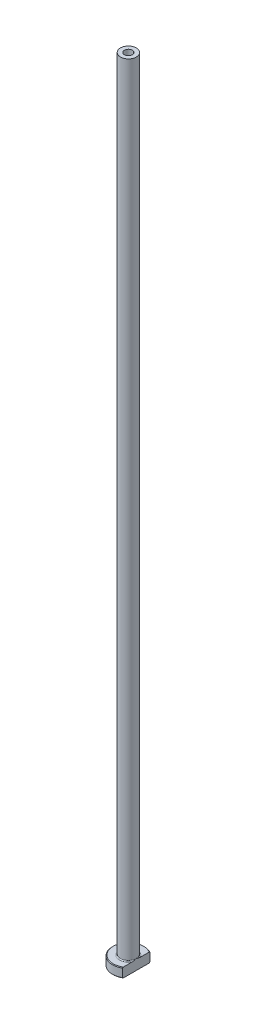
ISO-10303-21;
HEADER;
FILE_DESCRIPTION(('STEP AP214'),'2;1');
FILE_NAME('part.step','',(''),(''),'','','');
FILE_SCHEMA(('AUTOMOTIVE_DESIGN { 1 0 10303 214 1 1 1 1 }'));
ENDSEC;
DATA;
#1=APPLICATION_CONTEXT('core data for automotive mechanical design processes');
#2=APPLICATION_PROTOCOL_DEFINITION('international standard','automotive_design',2000,#1);
#3=PRODUCT_CONTEXT('',#1,'mechanical');
#4=PRODUCT('Part','Part','',(#3));
#5=PRODUCT_RELATED_PRODUCT_CATEGORY('part','',(#4));
#6=PRODUCT_DEFINITION_FORMATION('','',#4);
#7=PRODUCT_DEFINITION_CONTEXT('part definition',#1,'design');
#8=PRODUCT_DEFINITION('design','',#6,#7);
#9=PRODUCT_DEFINITION_SHAPE('','',#8);
#10=(LENGTH_UNIT() NAMED_UNIT(*) SI_UNIT(.MILLI.,.METRE.));
#11=(NAMED_UNIT(*) PLANE_ANGLE_UNIT() SI_UNIT($,.RADIAN.));
#12=(NAMED_UNIT(*) SI_UNIT($,.STERADIAN.) SOLID_ANGLE_UNIT());
#13=UNCERTAINTY_MEASURE_WITH_UNIT(LENGTH_MEASURE(1.E-05),#10,'distance_accuracy_value','');
#14=(GEOMETRIC_REPRESENTATION_CONTEXT(3) GLOBAL_UNCERTAINTY_ASSIGNED_CONTEXT((#13)) GLOBAL_UNIT_ASSIGNED_CONTEXT((#10,
#11,#12)) REPRESENTATION_CONTEXT('',''));
#15=CARTESIAN_POINT('',(0.,0.,0.));
#16=DIRECTION('',(0.,0.,1.));
#17=DIRECTION('',(1.,0.,0.));
#18=AXIS2_PLACEMENT_3D('',#15,#16,#17);
#19=CARTESIAN_POINT('',(0.,92.1876809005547,0.));
#20=DIRECTION('',(0.,1.,0.));
#21=DIRECTION('',(0.,0.,1.));
#22=AXIS2_PLACEMENT_3D('',#19,#20,#21);
#23=CYLINDRICAL_SURFACE('',#22,1.25000000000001);
#24=CARTESIAN_POINT('',(0.,250.,0.));
#25=DIRECTION('',(0.,1.,0.));
#26=DIRECTION('',(0.,0.,1.));
#27=AXIS2_PLACEMENT_3D('',#24,#25,#26);
#28=CIRCLE('',#27,1.25000000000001);
#29=CARTESIAN_POINT('',(0.,250.,1.25000000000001));
#30=VERTEX_POINT('',#29);
#31=EDGE_CURVE('E167',#30,#30,#28,.T.);
#32=ORIENTED_EDGE('',*,*,#31,.T.);
#33=EDGE_LOOP('',(#32));
#34=FACE_BOUND('',#33,.T.);
#35=CARTESIAN_POINT('',(0.,215.,0.));
#36=DIRECTION('',(0.,1.,0.));
#37=DIRECTION('',(0.,0.,1.));
#38=AXIS2_PLACEMENT_3D('',#35,#36,#37);
#39=CIRCLE('',#38,1.25000000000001);
#40=CARTESIAN_POINT('',(0.,215.,1.25000000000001));
#41=VERTEX_POINT('',#40);
#42=EDGE_CURVE('E170',#41,#41,#39,.T.);
#43=ORIENTED_EDGE('',*,*,#42,.F.);
#44=EDGE_LOOP('',(#43));
#45=FACE_BOUND('',#44,.T.);
#46=ADVANCED_FACE('F32',(#34,#45),#23,.F.);
#47=CARTESIAN_POINT('',(-1.25000000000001,250.,0.));
#48=DIRECTION('',(0.,1.,0.));
#49=DIRECTION('',(0.,0.,1.));
#50=AXIS2_PLACEMENT_3D('',#47,#48,#49);
#51=PLANE('',#50);
#52=CARTESIAN_POINT('',(0.,250.,0.));
#53=DIRECTION('',(0.,1.,0.));
#54=DIRECTION('',(0.,0.,1.));
#55=AXIS2_PLACEMENT_3D('',#52,#53,#54);
#56=CIRCLE('',#55,2.50000000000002);
#57=CARTESIAN_POINT('',(0.,250.,2.50000000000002));
#58=VERTEX_POINT('',#57);
#59=EDGE_CURVE('E174',#58,#58,#56,.T.);
#60=ORIENTED_EDGE('',*,*,#59,.T.);
#61=EDGE_LOOP('',(#60));
#62=FACE_BOUND('',#61,.T.);
#63=ORIENTED_EDGE('',*,*,#31,.F.);
#64=EDGE_LOOP('',(#63));
#65=FACE_BOUND('',#64,.T.);
#66=ADVANCED_FACE('F157',(#62,#65),#51,.T.);
#67=CARTESIAN_POINT('',(0.,92.1876809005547,0.));
#68=DIRECTION('',(0.,1.,0.));
#69=DIRECTION('',(0.,0.,1.));
#70=AXIS2_PLACEMENT_3D('',#67,#68,#69);
#71=CYLINDRICAL_SURFACE('',#70,2.5);
#72=CARTESIAN_POINT('',(0.,3.3,0.));
#73=DIRECTION('',(0.,1.,0.));
#74=DIRECTION('',(0.,0.,1.));
#75=AXIS2_PLACEMENT_3D('',#72,#73,#74);
#76=CIRCLE('',#75,2.5);
#77=CARTESIAN_POINT('',(2.5,3.3,0.));
#78=VERTEX_POINT('',#77);
#79=EDGE_CURVE('E180',#78,#78,#76,.T.);
#80=ORIENTED_EDGE('',*,*,#79,.T.);
#81=EDGE_LOOP('',(#80));
#82=FACE_BOUND('',#81,.T.);
#83=ORIENTED_EDGE('',*,*,#59,.F.);
#84=EDGE_LOOP('',(#83));
#85=FACE_BOUND('',#84,.T.);
#86=ADVANCED_FACE('F162',(#82,#85),#71,.T.);
#87=CARTESIAN_POINT('',(-2.49999999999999,3.,0.));
#88=DIRECTION('',(0.,1.,0.));
#89=DIRECTION('',(0.,0.,1.));
#90=AXIS2_PLACEMENT_3D('',#87,#88,#89);
#91=PLANE('',#90);
#92=DIRECTION('',(0.,0.,1.));
#93=VECTOR('',#92,1.);
#94=CARTESIAN_POINT('',(2.49999999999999,3.,0.));
#95=LINE('',#94,#93);
#96=CARTESIAN_POINT('',(2.5,3.,-4.09756024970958));
#97=VERTEX_POINT('',#96);
#98=CARTESIAN_POINT('',(2.49999999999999,3.,-1.26095202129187));
#99=VERTEX_POINT('',#98);
#100=EDGE_CURVE('E54',#97,#99,#95,.T.);
#101=ORIENTED_EDGE('',*,*,#100,.F.);
#102=CARTESIAN_POINT('',(0.,3.,0.));
#103=DIRECTION('',(0.,1.,0.));
#104=DIRECTION('',(0.,0.,1.));
#105=AXIS2_PLACEMENT_3D('',#102,#103,#104);
#106=CIRCLE('',#105,4.8);
#107=CARTESIAN_POINT('',(2.49999999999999,3.,4.09756024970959));
#108=VERTEX_POINT('',#107);
#109=EDGE_CURVE('E186',#97,#108,#106,.T.);
#110=ORIENTED_EDGE('',*,*,#109,.T.);
#111=CARTESIAN_POINT('',(2.49999999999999,3.,1.26095202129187));
#112=VERTEX_POINT('',#111);
#113=EDGE_CURVE('E134',#112,#108,#95,.T.);
#114=ORIENTED_EDGE('',*,*,#113,.F.);
#115=CARTESIAN_POINT('',(0.,3.,0.));
#116=DIRECTION('',(0.,1.,0.));
#117=DIRECTION('',(0.,0.,1.));
#118=AXIS2_PLACEMENT_3D('',#115,#116,#117);
#119=CIRCLE('',#118,2.8);
#120=EDGE_CURVE('E183',#112,#99,#119,.F.);
#121=ORIENTED_EDGE('',*,*,#120,.T.);
#122=EDGE_LOOP('',(#101,#110,#114,#121));
#123=FACE_BOUND('',#122,.T.);
#124=ADVANCED_FACE('F197',(#123),#91,.T.);
#125=CARTESIAN_POINT('',(0.,92.1876809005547,0.));
#126=DIRECTION('',(0.,1.,0.));
#127=DIRECTION('',(0.,0.,1.));
#128=AXIS2_PLACEMENT_3D('',#125,#126,#127);
#129=CYLINDRICAL_SURFACE('',#128,4.99999999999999);
#130=DIRECTION('',(0.,-1.,0.));
#131=VECTOR('',#130,1.);
#132=CARTESIAN_POINT('',(2.49999999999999,250.,4.33012701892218));
#133=LINE('',#132,#131);
#134=CARTESIAN_POINT('',(2.49999999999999,2.80000000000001,4.33012701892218));
#135=VERTEX_POINT('',#134);
#136=CARTESIAN_POINT('',(2.49999999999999,0.200000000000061,4.33012701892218));
#137=VERTEX_POINT('',#136);
#138=EDGE_CURVE('E82',#135,#137,#133,.T.);
#139=ORIENTED_EDGE('',*,*,#138,.F.);
#140=CARTESIAN_POINT('',(0.,2.80000000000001,0.));
#141=DIRECTION('',(0.,1.,0.));
#142=DIRECTION('',(0.,0.,1.));
#143=AXIS2_PLACEMENT_3D('',#140,#141,#142);
#144=CIRCLE('',#143,4.99999999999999);
#145=CARTESIAN_POINT('',(2.5,2.80000000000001,-4.33012701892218));
#146=VERTEX_POINT('',#145);
#147=EDGE_CURVE('E95',#135,#146,#144,.F.);
#148=ORIENTED_EDGE('',*,*,#147,.T.);
#149=DIRECTION('',(0.,-1.,0.));
#150=VECTOR('',#149,1.);
#151=CARTESIAN_POINT('',(2.5,250.,-4.33012701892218));
#152=LINE('',#151,#150);
#153=CARTESIAN_POINT('',(2.5,0.200000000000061,-4.33012701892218));
#154=VERTEX_POINT('',#153);
#155=EDGE_CURVE('E192',#146,#154,#152,.T.);
#156=ORIENTED_EDGE('',*,*,#155,.T.);
#157=CARTESIAN_POINT('',(0.,0.200000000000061,0.));
#158=DIRECTION('',(0.,-1.,0.));
#159=DIRECTION('',(0.,0.,-1.));
#160=AXIS2_PLACEMENT_3D('',#157,#158,#159);
#161=CIRCLE('',#160,4.99999999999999);
#162=EDGE_CURVE('E98',#154,#137,#161,.F.);
#163=ORIENTED_EDGE('',*,*,#162,.T.);
#164=EDGE_LOOP('',(#139,#148,#156,#163));
#165=FACE_BOUND('',#164,.T.);
#166=ADVANCED_FACE('F190',(#165),#129,.T.);
#167=CARTESIAN_POINT('',(-4.99999999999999,0.,0.));
#168=DIRECTION('',(0.,-1.,0.));
#169=DIRECTION('',(0.,0.,-1.));
#170=AXIS2_PLACEMENT_3D('',#167,#168,#169);
#171=PLANE('',#170);
#172=CARTESIAN_POINT('',(0.,0.,0.));
#173=DIRECTION('',(0.,-1.,0.));
#174=DIRECTION('',(0.,0.,-1.));
#175=AXIS2_PLACEMENT_3D('',#172,#173,#174);
#176=CIRCLE('',#175,2.00000000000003);
#177=CARTESIAN_POINT('',(0.,0.,-2.00000000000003));
#178=VERTEX_POINT('',#177);
#179=EDGE_CURVE('E40',#178,#178,#176,.F.);
#180=ORIENTED_EDGE('',*,*,#179,.T.);
#181=EDGE_LOOP('',(#180));
#182=FACE_BOUND('',#181,.T.);
#183=DIRECTION('',(0.,0.,-1.));
#184=VECTOR('',#183,1.);
#185=CARTESIAN_POINT('',(2.49999999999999,0.,4.33012701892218));
#186=LINE('',#185,#184);
#187=CARTESIAN_POINT('',(2.49999999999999,0.,4.09756024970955));
#188=VERTEX_POINT('',#187);
#189=CARTESIAN_POINT('',(2.5,0.,-4.09756024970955));
#190=VERTEX_POINT('',#189);
#191=EDGE_CURVE('E47',#188,#190,#186,.T.);
#192=ORIENTED_EDGE('',*,*,#191,.F.);
#193=CARTESIAN_POINT('',(0.,0.,0.));
#194=DIRECTION('',(0.,-1.,0.));
#195=DIRECTION('',(0.,0.,-1.));
#196=AXIS2_PLACEMENT_3D('',#193,#194,#195);
#197=CIRCLE('',#196,4.79999999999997);
#198=EDGE_CURVE('E92',#188,#190,#197,.T.);
#199=ORIENTED_EDGE('',*,*,#198,.T.);
#200=EDGE_LOOP('',(#192,#199));
#201=FACE_BOUND('',#200,.T.);
#202=ADVANCED_FACE('F91',(#182,#201),#171,.T.);
#203=CARTESIAN_POINT('',(0.,92.1876809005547,0.));
#204=DIRECTION('',(0.,1.,0.));
#205=DIRECTION('',(0.,0.,1.));
#206=AXIS2_PLACEMENT_3D('',#203,#204,#205);
#207=CYLINDRICAL_SURFACE('',#206,1.5);
#208=CARTESIAN_POINT('',(0.,0.500000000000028,0.));
#209=DIRECTION('',(0.,-1.,0.));
#210=DIRECTION('',(0.,0.,-1.));
#211=AXIS2_PLACEMENT_3D('',#208,#209,#210);
#212=CIRCLE('',#211,1.5);
#213=CARTESIAN_POINT('',(0.,0.500000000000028,-1.5));
#214=VERTEX_POINT('',#213);
#215=EDGE_CURVE('E11',#214,#214,#212,.T.);
#216=ORIENTED_EDGE('',*,*,#215,.T.);
#217=EDGE_LOOP('',(#216));
#218=FACE_BOUND('',#217,.T.);
#219=CARTESIAN_POINT('',(0.,203.,0.));
#220=DIRECTION('',(0.,1.,0.));
#221=DIRECTION('',(0.,0.,1.));
#222=AXIS2_PLACEMENT_3D('',#219,#220,#221);
#223=CIRCLE('',#222,1.50000000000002);
#224=CARTESIAN_POINT('',(0.,203.,1.50000000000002));
#225=VERTEX_POINT('',#224);
#226=EDGE_CURVE('E172',#225,#225,#223,.T.);
#227=ORIENTED_EDGE('',*,*,#226,.T.);
#228=EDGE_LOOP('',(#227));
#229=FACE_BOUND('',#228,.T.);
#230=ADVANCED_FACE('F215',(#218,#229),#207,.F.);
#231=CARTESIAN_POINT('',(0.,203.,0.));
#232=DIRECTION('',(0.,-1.,0.));
#233=DIRECTION('',(0.,0.,-1.));
#234=AXIS2_PLACEMENT_3D('',#231,#232,#233);
#235=CONICAL_SURFACE('',#234,1.50000000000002,0.0208303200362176);
#236=ORIENTED_EDGE('',*,*,#42,.T.);
#237=EDGE_LOOP('',(#236));
#238=FACE_BOUND('',#237,.T.);
#239=ORIENTED_EDGE('',*,*,#226,.F.);
#240=EDGE_LOOP('',(#239));
#241=FACE_BOUND('',#240,.T.);
#242=ADVANCED_FACE('F111',(#238,#241),#235,.F.);
#243=CARTESIAN_POINT('',(0.,3.3,0.));
#244=DIRECTION('',(0.,1.,0.));
#245=DIRECTION('',(0.,0.,1.));
#246=AXIS2_PLACEMENT_3D('',#243,#244,#245);
#247=TOROIDAL_SURFACE('',#246,2.8,0.3);
#248=ORIENTED_EDGE('',*,*,#120,.F.);
#249=CARTESIAN_POINT('',(2.5,3.3,0.));
#250=CARTESIAN_POINT('',(2.5,3.30000062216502,-4.84267816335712E-11));
#251=CARTESIAN_POINT('',(2.5,3.30000124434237,1.59621078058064E-07));
#252=CARTESIAN_POINT('',(2.5,3.3000024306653,6.45478033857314E-07));
#253=CARTESIAN_POINT('',(2.5,3.30000299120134,9.78480795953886E-07));
#254=CARTESIAN_POINT('',(2.5,3.30000411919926,1.77471995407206E-06));
#255=CARTESIAN_POINT('',(2.5,3.30000467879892,2.24902162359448E-06));
#256=CARTESIAN_POINT('',(2.5,3.30000572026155,3.25953703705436E-06));
#257=CARTESIAN_POINT('',(2.5,3.30000620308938,3.79480766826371E-06));
#258=CARTESIAN_POINT('',(2.5,3.30000787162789,5.75794675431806E-06));
#259=CARTESIAN_POINT('',(2.5,3.30000896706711,7.26424177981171E-06));
#260=CARTESIAN_POINT('',(2.5,3.30001087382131,1.03361138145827E-05));
#261=CARTESIAN_POINT('',(2.5,3.30001169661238,1.18949507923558E-05));
#262=CARTESIAN_POINT('',(2.5,3.30001489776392,1.8140086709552E-05));
#263=CARTESIAN_POINT('',(2.5,3.30001712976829,2.29062198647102E-05));
#264=CARTESIAN_POINT('',(2.5,3.30002067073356,3.21793891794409E-05));
#265=CARTESIAN_POINT('',(2.5,3.3000220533,3.66589012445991E-05));
#266=CARTESIAN_POINT('',(2.5,3.30002810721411,5.61718442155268E-05));
#267=CARTESIAN_POINT('',(2.5,3.30003284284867,7.11735916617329E-05));
#268=CARTESIAN_POINT('',(2.5,3.30004025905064,9.89920389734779E-05));
#269=CARTESIAN_POINT('',(2.5,3.30004315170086,0.000111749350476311));
#270=CARTESIAN_POINT('',(2.49999999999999,3.30006652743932,0.000206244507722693));
#271=CARTESIAN_POINT('',(2.49999999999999,3.30009698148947,0.000285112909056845));
#272=CARTESIAN_POINT('',(2.5,3.30021213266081,0.000594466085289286));
#273=CARTESIAN_POINT('',(2.5,3.30028938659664,0.000826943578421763));
#274=CARTESIAN_POINT('',(2.49999999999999,3.3005968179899,0.0017388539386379));
#275=CARTESIAN_POINT('',(2.49999999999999,3.30083479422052,0.00241625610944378));
#276=CARTESIAN_POINT('',(2.5,3.30181198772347,0.0052106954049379));
#277=CARTESIAN_POINT('',(2.5,3.30254240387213,0.00732996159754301));
#278=CARTESIAN_POINT('',(2.49999999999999,3.31226043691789,0.0355096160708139));
#279=CARTESIAN_POINT('',(2.49999999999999,3.32130808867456,0.06155511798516));
#280=CARTESIAN_POINT('',(2.5,3.33896212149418,0.112677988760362));
#281=CARTESIAN_POINT('',(2.5,3.34757212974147,0.137754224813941));
#282=CARTESIAN_POINT('',(2.49999999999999,3.36573068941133,0.190981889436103));
#283=CARTESIAN_POINT('',(2.5,3.37526654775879,0.219137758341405));
#284=CARTESIAN_POINT('',(2.5,3.3942286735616,0.275816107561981));
#285=CARTESIAN_POINT('',(2.5,3.40365272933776,0.304339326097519));
#286=CARTESIAN_POINT('',(2.5,3.42641697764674,0.37441674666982));
#287=CARTESIAN_POINT('',(2.5,3.43959811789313,0.416023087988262));
#288=CARTESIAN_POINT('',(2.5,3.46479157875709,0.498481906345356));
#289=CARTESIAN_POINT('',(2.5,3.47682455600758,0.539328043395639));
#290=CARTESIAN_POINT('',(2.5,3.50224427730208,0.629981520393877));
#291=CARTESIAN_POINT('',(2.5,3.51538048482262,0.679860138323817));
#292=CARTESIAN_POINT('',(2.5,3.5396407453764,0.780511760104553));
#293=CARTESIAN_POINT('',(2.5,3.55074877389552,0.831288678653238));
#294=CARTESIAN_POINT('',(2.5,3.57087054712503,0.937063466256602));
#295=CARTESIAN_POINT('',(2.5,3.57967623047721,0.992102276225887));
#296=CARTESIAN_POINT('',(2.5,3.59301148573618,1.10256024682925));
#297=CARTESIAN_POINT('',(2.5,3.59755297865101,1.15797790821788));
#298=CARTESIAN_POINT('',(2.5,3.60093314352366,1.26786705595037));
#299=CARTESIAN_POINT('',(2.5,3.59989366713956,1.3223329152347));
#300=CARTESIAN_POINT('',(2.5,3.59277279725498,1.40310062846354));
#301=CARTESIAN_POINT('',(2.5,3.5895213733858,1.42965222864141));
#302=CARTESIAN_POINT('',(2.5,3.58085857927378,1.4823907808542));
#303=CARTESIAN_POINT('',(2.5,3.57544928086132,1.50857805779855));
#304=CARTESIAN_POINT('',(2.5,3.5629881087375,1.55658799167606));
#305=CARTESIAN_POINT('',(2.5,3.55628200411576,1.57849902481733));
#306=CARTESIAN_POINT('',(2.5,3.54055393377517,1.62160292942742));
#307=CARTESIAN_POINT('',(2.5,3.53152220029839,1.64279233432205));
#308=CARTESIAN_POINT('',(2.5,3.51057199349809,1.68404469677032));
#309=CARTESIAN_POINT('',(2.5,3.49862012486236,1.70409105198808));
#310=CARTESIAN_POINT('',(2.5,3.47134074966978,1.74172093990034));
#311=CARTESIAN_POINT('',(2.5,3.45603127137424,1.75931683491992));
#312=CARTESIAN_POINT('',(2.5,3.42979930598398,1.78297070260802));
#313=CARTESIAN_POINT('',(2.5,3.42024268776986,1.79054141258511));
#314=CARTESIAN_POINT('',(2.5,3.40009035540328,1.8041699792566));
#315=CARTESIAN_POINT('',(2.5,3.3894949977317,1.81022835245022));
#316=CARTESIAN_POINT('',(2.5,3.36727740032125,1.82047087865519));
#317=CARTESIAN_POINT('',(2.5,3.35564531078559,1.82463409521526));
#318=CARTESIAN_POINT('',(2.5,3.33178837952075,1.83058442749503));
#319=CARTESIAN_POINT('',(2.5,3.31956435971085,1.83237474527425));
#320=CARTESIAN_POINT('',(2.5,3.2966573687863,1.83331852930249));
#321=CARTESIAN_POINT('',(2.5,3.28598670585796,1.83279233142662));
#322=CARTESIAN_POINT('',(2.5,3.26490749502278,1.8298630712));
#323=CARTESIAN_POINT('',(2.5,3.25449899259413,1.82745968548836));
#324=CARTESIAN_POINT('',(2.5,3.23467098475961,1.82111257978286));
#325=CARTESIAN_POINT('',(2.5,3.22522816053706,1.81724026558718));
#326=CARTESIAN_POINT('',(2.5,3.20699535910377,1.80819497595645));
#327=CARTESIAN_POINT('',(2.5,3.19820556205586,1.80302164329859));
#328=CARTESIAN_POINT('',(2.5,3.17663162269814,1.7884211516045));
#329=CARTESIAN_POINT('',(2.5,3.16436228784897,1.77823293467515));
#330=CARTESIAN_POINT('',(2.5,3.14157828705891,1.75604629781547));
#331=CARTESIAN_POINT('',(2.5,3.13106906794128,1.74404246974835));
#332=CARTESIAN_POINT('',(2.5,3.10600520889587,1.71142114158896));
#333=CARTESIAN_POINT('',(2.5,3.09267476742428,1.68986887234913));
#334=CARTESIAN_POINT('',(2.5,3.06940323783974,1.64508572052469));
#335=CARTESIAN_POINT('',(2.5,3.05946314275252,1.62185434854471));
#336=CARTESIAN_POINT('',(2.5,3.03545750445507,1.55546754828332));
#337=CARTESIAN_POINT('',(2.5,3.02444022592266,1.51122187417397));
#338=CARTESIAN_POINT('',(2.5,3.00863926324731,1.42119777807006));
#339=CARTESIAN_POINT('',(2.5,3.0039387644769,1.37540689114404));
#340=CARTESIAN_POINT('',(2.5,2.9992421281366,1.28072198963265));
#341=CARTESIAN_POINT('',(2.5,2.99956098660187,1.23181420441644));
#342=CARTESIAN_POINT('',(2.5,3.00436098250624,1.134109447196));
#343=CARTESIAN_POINT('',(2.5,3.00885327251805,1.08531312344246));
#344=CARTESIAN_POINT('',(2.5,3.02074191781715,0.990773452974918));
#345=CARTESIAN_POINT('',(2.5,3.0279679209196,0.945007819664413));
#346=CARTESIAN_POINT('',(2.5,3.04465555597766,0.854199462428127));
#347=CARTESIAN_POINT('',(2.5,3.054102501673,0.809153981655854));
#348=CARTESIAN_POINT('',(2.5,3.07710029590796,0.709411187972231));
#349=CARTESIAN_POINT('',(2.5,3.09109633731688,0.654817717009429));
#350=CARTESIAN_POINT('',(2.5,3.12140740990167,0.544863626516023));
#351=CARTESIAN_POINT('',(2.49999999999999,3.13777040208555,0.489516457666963));
#352=CARTESIAN_POINT('',(2.5,3.16649540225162,0.396740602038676));
#353=CARTESIAN_POINT('',(2.5,3.17848130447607,0.359193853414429));
#354=CARTESIAN_POINT('',(2.49999999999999,3.20280507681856,0.28465180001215));
#355=CARTESIAN_POINT('',(2.49999999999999,3.21513791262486,0.247654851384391));
#356=CARTESIAN_POINT('',(2.5,3.23873713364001,0.177767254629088));
#357=CARTESIAN_POINT('',(2.50000000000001,3.2499740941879,0.144866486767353));
#358=CARTESIAN_POINT('',(2.49999999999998,3.2730714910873,0.0777985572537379));
#359=CARTESIAN_POINT('',(2.49999999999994,3.28493883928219,0.0436336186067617));
#360=CARTESIAN_POINT('',(2.5,3.2974579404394,0.00732879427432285));
#361=CARTESIAN_POINT('',(2.5,3.29818879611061,0.00520838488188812));
#362=CARTESIAN_POINT('',(2.49999999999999,3.29916610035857,0.00241367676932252));
#363=CARTESIAN_POINT('',(2.49999999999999,3.29940376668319,0.00173715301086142));
#364=CARTESIAN_POINT('',(2.5,3.29971082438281,0.000826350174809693));
#365=CARTESIAN_POINT('',(2.5,3.29978800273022,0.000594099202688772));
#366=CARTESIAN_POINT('',(2.49999999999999,3.29990305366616,0.000285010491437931));
#367=CARTESIAN_POINT('',(2.49999999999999,3.2999334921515,0.000206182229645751));
#368=CARTESIAN_POINT('',(2.5,3.29995685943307,0.000111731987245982));
#369=CARTESIAN_POINT('',(2.5,3.29995975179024,9.89774380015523E-05));
#370=CARTESIAN_POINT('',(2.5,3.29996716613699,7.11651929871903E-05));
#371=CARTESIAN_POINT('',(2.5,3.29997189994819,5.61668128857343E-05));
#372=CARTESIAN_POINT('',(2.5,3.29997795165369,3.66576347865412E-05));
#373=CARTESIAN_POINT('',(2.5,3.29997933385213,3.21785265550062E-05));
#374=CARTESIAN_POINT('',(2.5,3.29998287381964,2.29061391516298E-05));
#375=CARTESIAN_POINT('',(2.5,3.29998510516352,1.81403673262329E-05));
#376=CARTESIAN_POINT('',(2.5,3.29998830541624,1.18955828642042E-05));
#377=CARTESIAN_POINT('',(2.5,3.29998912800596,1.03367768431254E-05));
#378=CARTESIAN_POINT('',(2.5,3.29999103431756,7.26492833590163E-06));
#379=CARTESIAN_POINT('',(2.5,3.29999212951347,5.758623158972E-06));
#380=CARTESIAN_POINT('',(2.5,3.29999379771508,3.79542482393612E-06));
#381=CARTESIAN_POINT('',(2.5,3.29999428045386,3.26012775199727E-06));
#382=CARTESIAN_POINT('',(2.5,3.29999532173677,2.24954342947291E-06));
#383=CARTESIAN_POINT('',(2.5,3.2999958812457,1.7751990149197E-06));
#384=CARTESIAN_POINT('',(2.5,3.29999700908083,9.78857132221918E-07));
#385=CARTESIAN_POINT('',(2.5,3.29999756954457,6.45797082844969E-07));
#386=CARTESIAN_POINT('',(2.5,3.29999875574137,1.59799615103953E-07));
#387=CARTESIAN_POINT('',(2.5,3.29999937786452,4.84249830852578E-11));
#388=CARTESIAN_POINT('',(2.5,3.3,0.));
#389=B_SPLINE_CURVE_WITH_KNOTS('',3,(#249,#250,#251,#252,#253,#254,#255,#256,#257,#258,#259,
#260,#261,#262,#263,#264,#265,#266,#267,#268,#269,#270,#271,#272,#273,#274,#275,#276,#277,#278,
#279,#280,#281,#282,#283,#284,#285,#286,#287,#288,#289,#290,#291,#292,#293,#294,#295,#296,#297,
#298,#299,#300,#301,#302,#303,#304,#305,#306,#307,#308,#309,#310,#311,#312,#313,#314,#315,#316,
#317,#318,#319,#320,#321,#322,#323,#324,#325,#326,#327,#328,#329,#330,#331,#332,#333,#334,#335,
#336,#337,#338,#339,#340,#341,#342,#343,#344,#345,#346,#347,#348,#349,#350,#351,#352,#353,#354,
#355,#356,#357,#358,#359,#360,#361,#362,#363,#364,#365,#366,#367,#368,#369,#370,#371,#372,#373,
#374,#375,#376,#377,#378,#379,#380,#381,#382,#383,#384,#385,#386,#387,#388),.UNSPECIFIED.,.T.,
.F.,(4,2,2,2,2,2,2,2,2,2,2,2,2,2,2,2,2,2,2,2,2,2,2,2,2,2,2,2,2,2,2,2,2,2,2,2,2,2,2,2,2,2,2,2,2,
2,2,2,2,2,2,2,2,2,2,2,2,2,2,2,2,2,2,2,2,2,2,2,2,4),(0.,1.86789156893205E-06,
3.81549468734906E-06,6.00610277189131E-06,8.16652719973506E-06,1.37285559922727E-05,
1.90122133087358E-05,3.47597253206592E-05,4.88082571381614E-05,9.59978417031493E-05,
0.000135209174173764,0.000388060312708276,0.00112364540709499,0.00327678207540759,
0.0100024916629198,0.0927120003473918,0.172253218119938,0.261432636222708,0.351551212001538,
0.482477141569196,0.6102122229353,0.764915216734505,0.920792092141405,1.08787897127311,
1.25449733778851,1.41749285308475,1.49767530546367,1.5777809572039,1.6464248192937,
1.71536183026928,1.78512750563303,1.85452737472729,1.89099315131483,1.92744645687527,
1.96429324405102,2.00109025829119,2.03297105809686,2.06485735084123,2.09535926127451,
2.12586955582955,2.17344034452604,2.22115572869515,2.29675134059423,2.37236907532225,
2.50839721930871,2.64619971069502,2.79268284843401,2.93955855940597,3.07848421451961,
3.21651583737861,3.38554045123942,3.55865938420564,3.67689643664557,3.79388863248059,
3.8981908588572,4.00668323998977,4.01341261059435,4.0155629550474,4.01629782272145,
4.0165505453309,4.01658974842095,4.01663692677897,4.01665097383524,4.01666671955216,
4.0166720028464,4.01667756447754,4.01667972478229,4.01668191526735,4.01668386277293,
4.01668573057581),.UNSPECIFIED.);
#390=EDGE_CURVE('E126',#112,#78,#389,.T.);
#391=ORIENTED_EDGE('',*,*,#390,.T.);
#392=ORIENTED_EDGE('',*,*,#79,.F.);
#393=CARTESIAN_POINT('',(2.5,3.3,0.));
#394=CARTESIAN_POINT('',(2.5,3.29999937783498,4.84272710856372E-11));
#395=CARTESIAN_POINT('',(2.5,3.29999875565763,-1.59621077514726E-07));
#396=CARTESIAN_POINT('',(2.5,3.2999975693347,-6.45478033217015E-07));
#397=CARTESIAN_POINT('',(2.5,3.29999700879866,-9.78480795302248E-07));
#398=CARTESIAN_POINT('',(2.5,3.29999588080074,-1.77471995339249E-06));
#399=CARTESIAN_POINT('',(2.5,3.29999532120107,-2.24902162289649E-06));
#400=CARTESIAN_POINT('',(2.5,3.29999427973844,-3.25953703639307E-06));
#401=CARTESIAN_POINT('',(2.5,3.29999379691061,-3.79480766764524E-06));
#402=CARTESIAN_POINT('',(2.5,3.2999921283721,-5.75794675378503E-06));
#403=CARTESIAN_POINT('',(2.5,3.29999103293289,-7.26424177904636E-06));
#404=CARTESIAN_POINT('',(2.5,3.29998912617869,-1.03361138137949E-05));
#405=CARTESIAN_POINT('',(2.5,3.29998830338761,-1.18949507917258E-05));
#406=CARTESIAN_POINT('',(2.5,3.29998510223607,-1.81400867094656E-05));
#407=CARTESIAN_POINT('',(2.5,3.2999828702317,-2.2906219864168E-05));
#408=CARTESIAN_POINT('',(2.5,3.29997932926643,-3.21793891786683E-05));
#409=CARTESIAN_POINT('',(2.5,3.29997794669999,-3.6658901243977E-05));
#410=CARTESIAN_POINT('',(2.5,3.29997189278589,-5.61718442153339E-05));
#411=CARTESIAN_POINT('',(2.5,3.29996715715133,-7.11735916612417E-05));
#412=CARTESIAN_POINT('',(2.5,3.29995974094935,-9.89920389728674E-05));
#413=CARTESIAN_POINT('',(2.5,3.29995684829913,-0.000111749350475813));
#414=CARTESIAN_POINT('',(2.49999999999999,3.29993347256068,-0.000206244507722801));
#415=CARTESIAN_POINT('',(2.49999999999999,3.29990301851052,-0.000285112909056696));
#416=CARTESIAN_POINT('',(2.5,3.29978786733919,-0.000594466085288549));
#417=CARTESIAN_POINT('',(2.5,3.29971061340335,-0.000826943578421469));
#418=CARTESIAN_POINT('',(2.49999999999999,3.2994031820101,-0.00173885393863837));
#419=CARTESIAN_POINT('',(2.49999999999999,3.29916520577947,-0.0024162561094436));
#420=CARTESIAN_POINT('',(2.5,3.29818801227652,-0.00521069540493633));
#421=CARTESIAN_POINT('',(2.5,3.29745759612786,-0.00732996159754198));
#422=CARTESIAN_POINT('',(2.49999999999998,3.28773956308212,-0.035509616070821));
#423=CARTESIAN_POINT('',(2.49999999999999,3.27869191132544,-0.0615551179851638));
#424=CARTESIAN_POINT('',(2.5,3.2610378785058,-0.112677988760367));
#425=CARTESIAN_POINT('',(2.5,3.25242787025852,-0.13775422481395));
#426=CARTESIAN_POINT('',(2.49999999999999,3.23426931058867,-0.190981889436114));
#427=CARTESIAN_POINT('',(2.49999999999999,3.2247334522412,-0.219137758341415));
#428=CARTESIAN_POINT('',(2.5,3.20577132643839,-0.275816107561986));
#429=CARTESIAN_POINT('',(2.5,3.19634727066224,-0.304339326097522));
#430=CARTESIAN_POINT('',(2.5,3.17358302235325,-0.374416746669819));
#431=CARTESIAN_POINT('',(2.5,3.16040188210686,-0.41602308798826));
#432=CARTESIAN_POINT('',(2.5,3.13520842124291,-0.498481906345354));
#433=CARTESIAN_POINT('',(2.5,3.12317544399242,-0.539328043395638));
#434=CARTESIAN_POINT('',(2.5,3.09775572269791,-0.629981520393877));
#435=CARTESIAN_POINT('',(2.5,3.08461951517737,-0.679860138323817));
#436=CARTESIAN_POINT('',(2.5,3.06035925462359,-0.780511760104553));
#437=CARTESIAN_POINT('',(2.5,3.04925122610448,-0.831288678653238));
#438=CARTESIAN_POINT('',(2.5,3.02912945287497,-0.937063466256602));
#439=CARTESIAN_POINT('',(2.5,3.02032376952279,-0.992102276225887));
#440=CARTESIAN_POINT('',(2.5,3.00698851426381,-1.10256024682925));
#441=CARTESIAN_POINT('',(2.5,3.00244702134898,-1.15797790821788));
#442=CARTESIAN_POINT('',(2.5,2.99906685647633,-1.26786705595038));
#443=CARTESIAN_POINT('',(2.5,3.00010633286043,-1.32233291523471));
#444=CARTESIAN_POINT('',(2.5,3.00722720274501,-1.40310062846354));
#445=CARTESIAN_POINT('',(2.5,3.0104786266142,-1.42965222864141));
#446=CARTESIAN_POINT('',(2.5,3.01914142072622,-1.4823907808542));
#447=CARTESIAN_POINT('',(2.5,3.02455071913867,-1.50857805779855));
#448=CARTESIAN_POINT('',(2.5,3.0370118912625,-1.55658799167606));
#449=CARTESIAN_POINT('',(2.5,3.04371799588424,-1.57849902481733));
#450=CARTESIAN_POINT('',(2.5,3.05944606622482,-1.62160292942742));
#451=CARTESIAN_POINT('',(2.5,3.06847779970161,-1.64279233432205));
#452=CARTESIAN_POINT('',(2.5,3.0894280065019,-1.68404469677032));
#453=CARTESIAN_POINT('',(2.5,3.10137987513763,-1.70409105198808));
#454=CARTESIAN_POINT('',(2.5,3.12865925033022,-1.74172093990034));
#455=CARTESIAN_POINT('',(2.5,3.14396872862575,-1.75931683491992));
#456=CARTESIAN_POINT('',(2.5,3.17020069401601,-1.78297070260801));
#457=CARTESIAN_POINT('',(2.5,3.17975731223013,-1.79054141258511));
#458=CARTESIAN_POINT('',(2.5,3.19990964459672,-1.8041699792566));
#459=CARTESIAN_POINT('',(2.5,3.21050500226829,-1.81022835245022));
#460=CARTESIAN_POINT('',(2.5,3.23272259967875,-1.82047087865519));
#461=CARTESIAN_POINT('',(2.5,3.24435468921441,-1.82463409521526));
#462=CARTESIAN_POINT('',(2.5,3.26821162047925,-1.83058442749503));
#463=CARTESIAN_POINT('',(2.5,3.28043564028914,-1.83237474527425));
#464=CARTESIAN_POINT('',(2.5,3.30334263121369,-1.83331852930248));
#465=CARTESIAN_POINT('',(2.5,3.31401329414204,-1.83279233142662));
#466=CARTESIAN_POINT('',(2.5,3.33509250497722,-1.8298630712));
#467=CARTESIAN_POINT('',(2.5,3.34550100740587,-1.82745968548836));
#468=CARTESIAN_POINT('',(2.5,3.36532901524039,-1.82111257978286));
#469=CARTESIAN_POINT('',(2.5,3.37477183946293,-1.81724026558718));
#470=CARTESIAN_POINT('',(2.5,3.39300464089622,-1.80819497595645));
#471=CARTESIAN_POINT('',(2.5,3.40179443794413,-1.80302164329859));
#472=CARTESIAN_POINT('',(2.5,3.42336837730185,-1.7884211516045));
#473=CARTESIAN_POINT('',(2.5,3.43563771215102,-1.77823293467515));
#474=CARTESIAN_POINT('',(2.5,3.45842171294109,-1.75604629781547));
#475=CARTESIAN_POINT('',(2.5,3.46893093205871,-1.74404246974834));
#476=CARTESIAN_POINT('',(2.5,3.49399479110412,-1.71142114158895));
#477=CARTESIAN_POINT('',(2.5,3.50732523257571,-1.68986887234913));
#478=CARTESIAN_POINT('',(2.5,3.53059676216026,-1.64508572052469));
#479=CARTESIAN_POINT('',(2.5,3.54053685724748,-1.62185434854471));
#480=CARTESIAN_POINT('',(2.5,3.56454249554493,-1.55546754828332));
#481=CARTESIAN_POINT('',(2.5,3.57555977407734,-1.51122187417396));
#482=CARTESIAN_POINT('',(2.5,3.59136073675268,-1.42119777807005));
#483=CARTESIAN_POINT('',(2.5,3.5960612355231,-1.37540689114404));
#484=CARTESIAN_POINT('',(2.5,3.6007578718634,-1.28072198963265));
#485=CARTESIAN_POINT('',(2.5,3.60043901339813,-1.23181420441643));
#486=CARTESIAN_POINT('',(2.5,3.59563901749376,-1.134109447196));
#487=CARTESIAN_POINT('',(2.5,3.59114672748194,-1.08531312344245));
#488=CARTESIAN_POINT('',(2.5,3.57925808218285,-0.990773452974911));
#489=CARTESIAN_POINT('',(2.5,3.57203207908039,-0.945007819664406));
#490=CARTESIAN_POINT('',(2.5,3.55534444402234,-0.85419946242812));
#491=CARTESIAN_POINT('',(2.5,3.545897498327,-0.809153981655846));
#492=CARTESIAN_POINT('',(2.5,3.52289970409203,-0.709411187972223));
#493=CARTESIAN_POINT('',(2.5,3.50890366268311,-0.654817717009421));
#494=CARTESIAN_POINT('',(2.5,3.47859259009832,-0.544863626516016));
#495=CARTESIAN_POINT('',(2.5,3.46222959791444,-0.489516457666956));
#496=CARTESIAN_POINT('',(2.5,3.43350459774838,-0.396740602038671));
#497=CARTESIAN_POINT('',(2.5,3.42151869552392,-0.359193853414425));
#498=CARTESIAN_POINT('',(2.49999999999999,3.39719492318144,-0.284651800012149));
#499=CARTESIAN_POINT('',(2.49999999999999,3.38486208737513,-0.247654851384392));
#500=CARTESIAN_POINT('',(2.5,3.36126286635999,-0.177767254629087));
#501=CARTESIAN_POINT('',(2.5,3.35002590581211,-0.144866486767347));
#502=CARTESIAN_POINT('',(2.49999999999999,3.32692850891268,-0.0777985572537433));
#503=CARTESIAN_POINT('',(2.49999999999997,3.31506116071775,-0.0436336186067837));
#504=CARTESIAN_POINT('',(2.5,3.30254205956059,-0.00732879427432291));
#505=CARTESIAN_POINT('',(2.5,3.30181120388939,-0.00520838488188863));
#506=CARTESIAN_POINT('',(2.49999999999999,3.30083389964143,-0.0024136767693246));
#507=CARTESIAN_POINT('',(2.49999999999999,3.30059623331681,-0.00173715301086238));
#508=CARTESIAN_POINT('',(2.5,3.30028917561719,-0.000826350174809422));
#509=CARTESIAN_POINT('',(2.5,3.30021199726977,-0.000594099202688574));
#510=CARTESIAN_POINT('',(2.49999999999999,3.30009694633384,-0.000285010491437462));
#511=CARTESIAN_POINT('',(2.49999999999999,3.30006650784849,-0.000206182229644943));
#512=CARTESIAN_POINT('',(2.5,3.30004314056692,-0.000111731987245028));
#513=CARTESIAN_POINT('',(2.5,3.30004024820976,-9.89774380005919E-05));
#514=CARTESIAN_POINT('',(2.5,3.300032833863,-7.11651929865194E-05));
#515=CARTESIAN_POINT('',(2.5,3.3000281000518,-5.61668128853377E-05));
#516=CARTESIAN_POINT('',(2.5,3.3000220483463,-3.66576347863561E-05));
#517=CARTESIAN_POINT('',(2.5,3.30002066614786,-3.21785265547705E-05));
#518=CARTESIAN_POINT('',(2.5,3.30001712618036,-2.29061391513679E-05));
#519=CARTESIAN_POINT('',(2.5,3.30001489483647,-1.81403673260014E-05));
#520=CARTESIAN_POINT('',(2.5,3.30001169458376,-1.18955828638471E-05));
#521=CARTESIAN_POINT('',(2.5,3.30001087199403,-1.03367768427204E-05));
#522=CARTESIAN_POINT('',(2.5,3.30000896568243,-7.26492833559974E-06));
#523=CARTESIAN_POINT('',(2.5,3.30000787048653,-5.75862315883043E-06));
#524=CARTESIAN_POINT('',(2.5,3.30000620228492,-3.79542482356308E-06));
#525=CARTESIAN_POINT('',(2.5,3.30000571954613,-3.26012775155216E-06));
#526=CARTESIAN_POINT('',(2.5,3.30000467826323,-2.24954342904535E-06));
#527=CARTESIAN_POINT('',(2.5,3.30000411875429,-1.77519901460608E-06));
#528=CARTESIAN_POINT('',(2.5,3.30000299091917,-9.78857131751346E-07));
#529=CARTESIAN_POINT('',(2.5,3.30000243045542,-6.45797082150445E-07));
#530=CARTESIAN_POINT('',(2.5,3.30000124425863,-1.59799614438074E-07));
#531=CARTESIAN_POINT('',(2.5,3.30000062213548,-4.84244709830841E-11));
#532=CARTESIAN_POINT('',(2.5,3.3,0.));
#533=B_SPLINE_CURVE_WITH_KNOTS('',3,(#393,#394,#395,#396,#397,#398,#399,#400,#401,#402,#403,
#404,#405,#406,#407,#408,#409,#410,#411,#412,#413,#414,#415,#416,#417,#418,#419,#420,#421,#422,
#423,#424,#425,#426,#427,#428,#429,#430,#431,#432,#433,#434,#435,#436,#437,#438,#439,#440,#441,
#442,#443,#444,#445,#446,#447,#448,#449,#450,#451,#452,#453,#454,#455,#456,#457,#458,#459,#460,
#461,#462,#463,#464,#465,#466,#467,#468,#469,#470,#471,#472,#473,#474,#475,#476,#477,#478,#479,
#480,#481,#482,#483,#484,#485,#486,#487,#488,#489,#490,#491,#492,#493,#494,#495,#496,#497,#498,
#499,#500,#501,#502,#503,#504,#505,#506,#507,#508,#509,#510,#511,#512,#513,#514,#515,#516,#517,
#518,#519,#520,#521,#522,#523,#524,#525,#526,#527,#528,#529,#530,#531,#532),.UNSPECIFIED.,.T.,
.F.,(4,2,2,2,2,2,2,2,2,2,2,2,2,2,2,2,2,2,2,2,2,2,2,2,2,2,2,2,2,2,2,2,2,2,2,2,2,2,2,2,2,2,2,2,2,
2,2,2,2,2,2,2,2,2,2,2,2,2,2,2,2,2,2,2,2,2,2,2,2,4),(0.,1.86789156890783E-06,
3.81549468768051E-06,6.00610277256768E-06,8.16652720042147E-06,1.37285559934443E-05,
1.9012213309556E-05,3.47597253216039E-05,4.88082571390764E-05,9.59978417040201E-05,
0.000135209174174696,0.000388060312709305,0.00112364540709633,0.00327678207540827,
0.0100024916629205,0.0927120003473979,0.172253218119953,0.261432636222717,0.35155121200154,
0.482477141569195,0.610212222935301,0.764915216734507,0.920792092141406,1.08787897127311,
1.25449733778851,1.41749285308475,1.49767530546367,1.57778095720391,1.64642481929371,
1.71536183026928,1.78512750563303,1.85452737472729,1.89099315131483,1.92744645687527,
1.96429324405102,2.0010902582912,2.03297105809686,2.06485735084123,2.09535926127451,
2.12586955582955,2.17344034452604,2.22115572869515,2.29675134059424,2.37236907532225,
2.50839721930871,2.64619971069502,2.79268284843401,2.93955855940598,3.07848421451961,
3.21651583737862,3.38554045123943,3.55865938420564,3.67689643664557,3.79388863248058,
3.89819085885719,4.00668323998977,4.01341261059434,4.0155629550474,4.01629782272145,
4.0165505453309,4.01658974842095,4.01663692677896,4.01665097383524,4.01666671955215,
4.0166720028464,4.01667756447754,4.01667972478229,4.01668191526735,4.01668386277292,
4.01668573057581),.UNSPECIFIED.);
#534=EDGE_CURVE('E135',#78,#99,#533,.T.);
#535=ORIENTED_EDGE('',*,*,#534,.T.);
#536=EDGE_LOOP('',(#248,#391,#392,#535));
#537=FACE_BOUND('',#536,.T.);
#538=ADVANCED_FACE('F141',(#537),#247,.F.);
#539=CARTESIAN_POINT('',(0.,3.,0.));
#540=DIRECTION('',(0.,-1.,0.));
#541=DIRECTION('',(0.,0.,-1.));
#542=AXIS2_PLACEMENT_3D('',#539,#540,#541);
#543=CONICAL_SURFACE('',#542,4.8,0.785398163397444);
#544=CARTESIAN_POINT('',(2.5,-2.05039133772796,-9.52786489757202));
#545=CARTESIAN_POINT('',(2.5,-1.84160367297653,-9.31199733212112));
#546=CARTESIAN_POINT('',(2.5,-1.63304008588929,-9.09591231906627));
#547=CARTESIAN_POINT('',(2.5,-1.21649358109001,-8.66317810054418));
#548=CARTESIAN_POINT('',(2.5,-1.00851067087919,-8.4465288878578));
#549=CARTESIAN_POINT('',(2.5,-0.59315724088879,-8.01243155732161));
#550=CARTESIAN_POINT('',(2.5,-0.385787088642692,-7.79498308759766));
#551=CARTESIAN_POINT('',(2.5,0.0280365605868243,-7.35921771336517));
#552=CARTESIAN_POINT('',(2.5,0.234490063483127,-7.14090081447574));
#553=CARTESIAN_POINT('',(2.5,0.642130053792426,-6.70748960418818));
#554=CARTESIAN_POINT('',(2.5,0.843339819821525,-6.4924172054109));
#555=CARTESIAN_POINT('',(2.5,1.24425381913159,-6.06087422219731));
#556=CARTESIAN_POINT('',(2.5,1.44395806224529,-5.84440364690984));
#557=CARTESIAN_POINT('',(2.5,1.84127751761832,-5.40963663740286));
#558=CARTESIAN_POINT('',(2.5,2.03889317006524,-5.19134060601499));
#559=CARTESIAN_POINT('',(2.5,2.43125043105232,-4.75218509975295));
#560=CARTESIAN_POINT('',(2.5,2.62599215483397,-4.5313257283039));
#561=CARTESIAN_POINT('',(2.5,2.93693788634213,-4.17181619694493));
#562=CARTESIAN_POINT('',(2.5,3.0544649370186,-4.03431188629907));
#563=CARTESIAN_POINT('',(2.5,3.28742704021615,-3.7575148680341));
#564=CARTESIAN_POINT('',(2.5,3.40286188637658,-3.61822198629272));
#565=CARTESIAN_POINT('',(2.5,3.63213234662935,-3.33586492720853));
#566=CARTESIAN_POINT('',(2.5,3.74593818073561,-3.19277645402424));
#567=CARTESIAN_POINT('',(2.5,3.96956266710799,-2.90356071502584));
#568=CARTESIAN_POINT('',(2.5,4.07938227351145,-2.75743418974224));
#569=CARTESIAN_POINT('',(2.5,4.29502410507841,-2.45881038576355));
#570=CARTESIAN_POINT('',(2.5,4.40076032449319,-2.30625006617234));
#571=CARTESIAN_POINT('',(2.5,4.55286945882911,-2.07299325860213));
#572=CARTESIAN_POINT('',(2.5,4.60252613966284,-1.9944419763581));
#573=CARTESIAN_POINT('',(2.5,4.69908164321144,-1.83566827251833));
#574=CARTESIAN_POINT('',(2.5,4.74598077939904,-1.75544604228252));
#575=CARTESIAN_POINT('',(2.5,4.83578466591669,-1.5940536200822));
#576=CARTESIAN_POINT('',(2.5,4.87873126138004,-1.51290702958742));
#577=CARTESIAN_POINT('',(2.5,4.96038600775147,-1.34852090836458));
#578=CARTESIAN_POINT('',(2.5,4.99909338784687,-1.26528100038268));
#579=CARTESIAN_POINT('',(2.5,5.10703093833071,-1.01251774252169));
#580=CARTESIAN_POINT('',(2.5,5.16843307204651,-0.83934206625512));
#581=CARTESIAN_POINT('',(2.5,5.23490554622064,-0.579703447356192));
#582=CARTESIAN_POINT('',(2.5,5.25253806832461,-0.496421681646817));
#583=CARTESIAN_POINT('',(2.5,5.27986337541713,-0.328535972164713));
#584=CARTESIAN_POINT('',(2.5,5.2895568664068,-0.243932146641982));
#585=CARTESIAN_POINT('',(2.5,5.30031768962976,-0.0744340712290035));
#586=CARTESIAN_POINT('',(2.5,5.30141176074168,0.0104584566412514));
#587=CARTESIAN_POINT('',(2.5,5.29496530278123,0.179916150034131));
#588=CARTESIAN_POINT('',(2.5,5.28742406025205,0.264481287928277));
#589=CARTESIAN_POINT('',(2.5,5.26433424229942,0.431754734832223));
#590=CARTESIAN_POINT('',(2.5,5.24885436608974,0.514472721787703));
#591=CARTESIAN_POINT('',(2.5,5.21085318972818,0.678257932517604));
#592=CARTESIAN_POINT('',(2.5,5.18833104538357,0.759324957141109));
#593=CARTESIAN_POINT('',(2.5,5.13718929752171,0.920001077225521));
#594=CARTESIAN_POINT('',(2.5,5.1085353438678,0.999599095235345));
#595=CARTESIAN_POINT('',(2.5,5.04628092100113,1.1567927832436));
#596=CARTESIAN_POINT('',(2.5,5.01268146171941,1.23438885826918));
#597=CARTESIAN_POINT('',(2.5,4.90558195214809,1.46503672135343));
#598=CARTESIAN_POINT('',(2.5,4.82601567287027,1.61526350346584));
#599=CARTESIAN_POINT('',(2.5,4.65635232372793,1.90970759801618));
#600=CARTESIAN_POINT('',(2.49999999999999,4.56624199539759,2.05391702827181));
#601=CARTESIAN_POINT('',(2.49999999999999,4.37862201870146,2.33821627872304));
#602=CARTESIAN_POINT('',(2.49999999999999,4.28108460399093,2.47828761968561));
#603=CARTESIAN_POINT('',(2.49999999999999,4.08116271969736,2.75478641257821));
#604=CARTESIAN_POINT('',(2.49999999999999,3.97878070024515,2.89121565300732));
#605=CARTESIAN_POINT('',(2.49999999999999,3.76913910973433,3.16313520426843));
#606=CARTESIAN_POINT('',(2.49999999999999,3.66183307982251,3.29858952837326));
#607=CARTESIAN_POINT('',(2.49999999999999,3.4445621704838,3.56736427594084));
#608=CARTESIAN_POINT('',(2.49999999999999,3.33459700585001,3.70068446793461));
#609=CARTESIAN_POINT('',(2.49999999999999,3.11293465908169,3.96532340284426));
#610=CARTESIAN_POINT('',(2.49999999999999,3.00124232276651,4.09664621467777));
#611=CARTESIAN_POINT('',(2.49999999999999,2.77631276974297,4.35796341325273));
#612=CARTESIAN_POINT('',(2.49999999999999,2.66307552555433,4.48795777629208));
#613=CARTESIAN_POINT('',(2.49999999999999,2.36028773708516,4.83228553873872));
#614=CARTESIAN_POINT('',(2.49999999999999,2.1696743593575,5.0456836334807));
#615=CARTESIAN_POINT('',(2.49999999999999,1.78611780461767,5.47037913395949));
#616=CARTESIAN_POINT('',(2.49999999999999,1.59317456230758,5.68167648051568));
#617=CARTESIAN_POINT('',(2.49999999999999,1.20540648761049,6.10290357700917));
#618=CARTESIAN_POINT('',(2.49999999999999,1.01058005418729,6.31283185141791));
#619=CARTESIAN_POINT('',(2.49999999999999,0.619649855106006,6.73149551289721));
#620=CARTESIAN_POINT('',(2.49999999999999,0.423546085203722,6.94023089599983));
#621=CARTESIAN_POINT('',(2.49999999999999,0.0384434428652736,7.34820392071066));
#622=CARTESIAN_POINT('',(2.49999999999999,-0.150515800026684,7.54747899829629));
#623=CARTESIAN_POINT('',(2.49999999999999,-0.529153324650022,7.94534601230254));
#624=CARTESIAN_POINT('',(2.49999999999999,-0.7188316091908,8.14393794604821));
#625=CARTESIAN_POINT('',(2.49999999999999,-1.09855461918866,8.54034636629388));
#626=CARTESIAN_POINT('',(2.49999999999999,-1.28859869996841,8.73816347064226));
#627=CARTESIAN_POINT('',(2.49999999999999,-1.6691626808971,9.13333639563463));
#628=CARTESIAN_POINT('',(2.49999999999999,-1.85968257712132,9.33069222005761));
#629=CARTESIAN_POINT('',(2.49999999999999,-2.05039133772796,9.52786489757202));
#630=B_SPLINE_CURVE_WITH_KNOTS('',3,(#544,#545,#546,#547,#548,#549,#550,#551,#552,#553,#554,
#555,#556,#557,#558,#559,#560,#561,#562,#563,#564,#565,#566,#567,#568,#569,#570,#571,#572,#573,
#574,#575,#576,#577,#578,#579,#580,#581,#582,#583,#584,#585,#586,#587,#588,#589,#590,#591,#592,
#593,#594,#595,#596,#597,#598,#599,#600,#601,#602,#603,#604,#605,#606,#607,#608,#609,#610,#611,
#612,#613,#614,#615,#616,#617,#618,#619,#620,#621,#622,#623,#624,#625,#626,#627,#628,#629),
.UNSPECIFIED.,.F.,.F.,(4,2,2,2,2,2,2,2,2,2,2,2,2,2,2,2,2,2,2,2,2,2,2,2,2,2,2,2,2,2,2,2,2,2,2,2,
2,2,2,2,2,2,4),(0.,0.900955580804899,1.80192274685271,2.70335062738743,3.60477268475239,
4.48832484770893,5.37187123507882,6.25522753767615,7.13854832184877,7.68119321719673,
8.22389134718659,8.77232299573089,9.32062249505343,9.87724663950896,10.1559936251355,
10.4347088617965,10.7100145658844,10.9853702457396,11.5339745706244,11.789046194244,
12.0440951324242,12.298350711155,12.5526272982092,12.8047396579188,13.0568822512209,
13.3104761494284,13.5640183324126,14.0732618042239,14.5831526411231,15.0950533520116,
15.6066978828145,16.1250759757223,16.6435099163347,17.1606868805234,17.6778730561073,
18.5362451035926,19.394641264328,20.2538459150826,21.1130534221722,21.9369112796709,
22.7607723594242,23.5837145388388,24.4066499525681),.UNSPECIFIED.);
#631=EDGE_CURVE('E133',#146,#97,#630,.T.);
#632=ORIENTED_EDGE('',*,*,#631,.F.);
#633=ORIENTED_EDGE('',*,*,#147,.F.);
#634=EDGE_CURVE('E118',#108,#135,#630,.T.);
#635=ORIENTED_EDGE('',*,*,#634,.F.);
#636=ORIENTED_EDGE('',*,*,#109,.F.);
#637=EDGE_LOOP('',(#632,#633,#635,#636));
#638=FACE_BOUND('',#637,.T.);
#639=ADVANCED_FACE('F145',(#638),#543,.T.);
#640=CARTESIAN_POINT('',(0.,0.200000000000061,0.));
#641=DIRECTION('',(0.,1.,0.));
#642=DIRECTION('',(0.,0.,1.));
#643=AXIS2_PLACEMENT_3D('',#640,#641,#642);
#644=CONICAL_SURFACE('',#643,4.99999999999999,0.78539816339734);
#645=CARTESIAN_POINT('',(2.49999999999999,5.05039133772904,9.52786489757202));
#646=CARTESIAN_POINT('',(2.49999999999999,4.84160367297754,9.31199733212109));
#647=CARTESIAN_POINT('',(2.49999999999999,4.63304008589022,9.09591231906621));
#648=CARTESIAN_POINT('',(2.49999999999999,4.21649358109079,8.66317810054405));
#649=CARTESIAN_POINT('',(2.49999999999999,4.0085106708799,8.44652888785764));
#650=CARTESIAN_POINT('',(2.49999999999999,3.59315724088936,8.01243155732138));
#651=CARTESIAN_POINT('',(2.49999999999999,3.38578708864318,7.7949830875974));
#652=CARTESIAN_POINT('',(2.49999999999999,2.97196343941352,7.35921771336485));
#653=CARTESIAN_POINT('',(2.49999999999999,2.76550993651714,7.14090081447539));
#654=CARTESIAN_POINT('',(2.49999999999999,2.35786994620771,6.70748960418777));
#655=CARTESIAN_POINT('',(2.49999999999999,2.15666018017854,6.49241720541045));
#656=CARTESIAN_POINT('',(2.49999999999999,1.75574618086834,6.06087422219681));
#657=CARTESIAN_POINT('',(2.49999999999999,1.55604193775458,5.84440364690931));
#658=CARTESIAN_POINT('',(2.49999999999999,1.15872248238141,5.40963663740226));
#659=CARTESIAN_POINT('',(2.49999999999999,0.961106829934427,5.19134060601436));
#660=CARTESIAN_POINT('',(2.49999999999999,0.568749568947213,4.75218509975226));
#661=CARTESIAN_POINT('',(2.49999999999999,0.374007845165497,4.53132572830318));
#662=CARTESIAN_POINT('',(2.49999999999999,0.0630621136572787,4.17181619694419));
#663=CARTESIAN_POINT('',(2.49999999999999,-0.0544649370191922,4.03431188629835));
#664=CARTESIAN_POINT('',(2.49999999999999,-0.28742704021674,3.75751486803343));
#665=CARTESIAN_POINT('',(2.49999999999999,-0.402861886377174,3.61822198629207));
#666=CARTESIAN_POINT('',(2.49999999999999,-0.63213234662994,3.33586492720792));
#667=CARTESIAN_POINT('',(2.49999999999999,-0.745938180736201,3.19277645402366));
#668=CARTESIAN_POINT('',(2.49999999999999,-0.969562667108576,2.9035607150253));
#669=CARTESIAN_POINT('',(2.49999999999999,-1.07938227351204,2.75743418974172));
#670=CARTESIAN_POINT('',(2.49999999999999,-1.29502410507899,2.45881038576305));
#671=CARTESIAN_POINT('',(2.5,-1.40076032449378,2.30625006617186));
#672=CARTESIAN_POINT('',(2.5,-1.55286945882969,2.07299325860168));
#673=CARTESIAN_POINT('',(2.5,-1.60252613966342,1.99444197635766));
#674=CARTESIAN_POINT('',(2.5,-1.69908164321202,1.83566827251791));
#675=CARTESIAN_POINT('',(2.5,-1.74598077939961,1.7554460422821));
#676=CARTESIAN_POINT('',(2.5,-1.83578466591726,1.59405362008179));
#677=CARTESIAN_POINT('',(2.5,-1.8787312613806,1.51290702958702));
#678=CARTESIAN_POINT('',(2.5,-1.96038600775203,1.34852090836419));
#679=CARTESIAN_POINT('',(2.5,-1.99909338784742,1.2652810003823));
#680=CARTESIAN_POINT('',(2.5,-2.10703093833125,1.01251774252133));
#681=CARTESIAN_POINT('',(2.5,-2.16843307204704,0.839342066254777));
#682=CARTESIAN_POINT('',(2.5,-2.23490554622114,0.579703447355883));
#683=CARTESIAN_POINT('',(2.5,-2.2525380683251,0.496421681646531));
#684=CARTESIAN_POINT('',(2.5,-2.27986337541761,0.328535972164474));
#685=CARTESIAN_POINT('',(2.5,-2.28955686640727,0.243932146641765));
#686=CARTESIAN_POINT('',(2.5,-2.30031768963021,0.0744340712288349));
#687=CARTESIAN_POINT('',(2.5,-2.30141176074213,-0.0104584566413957));
#688=CARTESIAN_POINT('',(2.5,-2.29496530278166,-0.179916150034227));
#689=CARTESIAN_POINT('',(2.5,-2.28742406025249,-0.264481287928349));
#690=CARTESIAN_POINT('',(2.5,-2.26433424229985,-0.431754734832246));
#691=CARTESIAN_POINT('',(2.5,-2.24885436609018,-0.514472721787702));
#692=CARTESIAN_POINT('',(2.5,-2.21085318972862,-0.678257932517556));
#693=CARTESIAN_POINT('',(2.5,-2.18833104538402,-0.759324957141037));
#694=CARTESIAN_POINT('',(2.5,-2.13718929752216,-0.920001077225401));
#695=CARTESIAN_POINT('',(2.5,-2.10853534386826,-0.999599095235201));
#696=CARTESIAN_POINT('',(2.5,-2.04628092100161,-1.15679278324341));
#697=CARTESIAN_POINT('',(2.5,-2.01268146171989,-1.23438885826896));
#698=CARTESIAN_POINT('',(2.5,-1.90558195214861,-1.46503672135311));
#699=CARTESIAN_POINT('',(2.5,-1.82601567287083,-1.61526350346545));
#700=CARTESIAN_POINT('',(2.5,-1.65635232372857,-1.90970759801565));
#701=CARTESIAN_POINT('',(2.5,-1.56624199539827,-2.0539170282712));
#702=CARTESIAN_POINT('',(2.5,-1.37862201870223,-2.33821627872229));
#703=CARTESIAN_POINT('',(2.5,-1.28108460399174,-2.4782876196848));
#704=CARTESIAN_POINT('',(2.5,-1.08116271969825,-2.75478641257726));
#705=CARTESIAN_POINT('',(2.5,-0.978780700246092,-2.8912156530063));
#706=CARTESIAN_POINT('',(2.5,-0.769139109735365,-3.16313520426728));
#707=CARTESIAN_POINT('',(2.5,-0.661833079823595,-3.29858952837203));
#708=CARTESIAN_POINT('',(2.5,-0.444562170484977,-3.56736427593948));
#709=CARTESIAN_POINT('',(2.5,-0.334597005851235,-3.70068446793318));
#710=CARTESIAN_POINT('',(2.5,-0.112934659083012,-3.96532340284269));
#711=CARTESIAN_POINT('',(2.5,-0.00124232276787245,-4.09664621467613));
#712=CARTESIAN_POINT('',(2.5,0.223687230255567,-4.35796341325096));
#713=CARTESIAN_POINT('',(2.5,0.336924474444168,-4.48795777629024));
#714=CARTESIAN_POINT('',(2.5,0.639712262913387,-4.8322855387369));
#715=CARTESIAN_POINT('',(2.5,0.830325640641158,-5.04568363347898));
#716=CARTESIAN_POINT('',(2.5,1.21388219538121,-5.47037913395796));
#717=CARTESIAN_POINT('',(2.5,1.40682543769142,-5.68167648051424));
#718=CARTESIAN_POINT('',(2.5,1.79459351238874,-6.10290357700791));
#719=CARTESIAN_POINT('',(2.5,1.98941994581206,-6.31283185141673));
#720=CARTESIAN_POINT('',(2.5,2.38035014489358,-6.73149551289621));
#721=CARTESIAN_POINT('',(2.5,2.57645391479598,-6.94023089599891));
#722=CARTESIAN_POINT('',(2.5,2.96155655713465,-7.3482039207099));
#723=CARTESIAN_POINT('',(2.5,3.15051580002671,-7.5474789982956));
#724=CARTESIAN_POINT('',(2.5,3.52915332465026,-7.94534601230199));
#725=CARTESIAN_POINT('',(2.5,3.71883160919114,-8.14393794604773));
#726=CARTESIAN_POINT('',(2.5,4.09855461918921,-8.54034636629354));
#727=CARTESIAN_POINT('',(2.5,4.28859869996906,-8.73816347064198));
#728=CARTESIAN_POINT('',(2.5,4.66916268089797,-9.13333639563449));
#729=CARTESIAN_POINT('',(2.5,4.8596825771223,-9.33069222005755));
#730=CARTESIAN_POINT('',(2.5,5.05039133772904,-9.52786489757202));
#731=B_SPLINE_CURVE_WITH_KNOTS('',3,(#645,#646,#647,#648,#649,#650,#651,#652,#653,#654,#655,
#656,#657,#658,#659,#660,#661,#662,#663,#664,#665,#666,#667,#668,#669,#670,#671,#672,#673,#674,
#675,#676,#677,#678,#679,#680,#681,#682,#683,#684,#685,#686,#687,#688,#689,#690,#691,#692,#693,
#694,#695,#696,#697,#698,#699,#700,#701,#702,#703,#704,#705,#706,#707,#708,#709,#710,#711,#712,
#713,#714,#715,#716,#717,#718,#719,#720,#721,#722,#723,#724,#725,#726,#727,#728,#729,#730),
.UNSPECIFIED.,.F.,.F.,(4,2,2,2,2,2,2,2,2,2,2,2,2,2,2,2,2,2,2,2,2,2,2,2,2,2,2,2,2,2,2,2,2,2,2,2,
2,2,2,2,2,2,4),(0.,0.900955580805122,1.80192274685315,2.7033506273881,3.60477268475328,
4.48832484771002,5.37187123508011,6.25522753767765,7.13854832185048,7.68119321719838,
8.22389134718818,8.77232299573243,9.32062249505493,9.87724663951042,10.1559936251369,
10.4347088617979,10.7100145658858,10.9853702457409,11.5339745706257,11.7890461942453,
12.0440951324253,12.2983507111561,12.5526272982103,12.8047396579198,13.0568822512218,
13.3104761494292,13.5640183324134,14.0732618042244,14.5831526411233,15.0950533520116,
15.6066978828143,16.1250759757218,16.643509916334,17.1606868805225,17.677873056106,
18.5362451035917,19.3946412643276,20.2538459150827,21.1130534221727,21.9369112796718,
22.7607723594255,23.5837145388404,24.40664995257),.UNSPECIFIED.);
#732=EDGE_CURVE('E79',#137,#188,#731,.T.);
#733=ORIENTED_EDGE('',*,*,#732,.F.);
#734=ORIENTED_EDGE('',*,*,#162,.F.);
#735=EDGE_CURVE('E87',#190,#154,#731,.T.);
#736=ORIENTED_EDGE('',*,*,#735,.F.);
#737=ORIENTED_EDGE('',*,*,#198,.F.);
#738=EDGE_LOOP('',(#733,#734,#736,#737));
#739=FACE_BOUND('',#738,.T.);
#740=ADVANCED_FACE('F94',(#739),#644,.T.);
#741=CARTESIAN_POINT('',(2.49999999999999,250.,4.33012701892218));
#742=DIRECTION('',(-1.,0.,0.));
#743=DIRECTION('',(0.,0.,1.));
#744=AXIS2_PLACEMENT_3D('',#741,#742,#743);
#745=PLANE('',#744);
#746=ORIENTED_EDGE('',*,*,#390,.F.);
#747=ORIENTED_EDGE('',*,*,#113,.T.);
#748=ORIENTED_EDGE('',*,*,#634,.T.);
#749=ORIENTED_EDGE('',*,*,#138,.T.);
#750=ORIENTED_EDGE('',*,*,#732,.T.);
#751=ORIENTED_EDGE('',*,*,#191,.T.);
#752=ORIENTED_EDGE('',*,*,#735,.T.);
#753=ORIENTED_EDGE('',*,*,#155,.F.);
#754=ORIENTED_EDGE('',*,*,#631,.T.);
#755=ORIENTED_EDGE('',*,*,#100,.T.);
#756=ORIENTED_EDGE('',*,*,#534,.F.);
#757=EDGE_LOOP('',(#746,#747,#748,#749,#750,#751,#752,#753,#754,#755,#756));
#758=FACE_BOUND('',#757,.T.);
#759=ADVANCED_FACE('F80',(#758),#745,.F.);
#760=CARTESIAN_POINT('',(0.,0.,0.));
#761=DIRECTION('',(0.,-1.,0.));
#762=DIRECTION('',(0.,0.,-1.));
#763=AXIS2_PLACEMENT_3D('',#760,#761,#762);
#764=CONICAL_SURFACE('',#763,2.00000000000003,0.785398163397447);
#765=ORIENTED_EDGE('',*,*,#215,.F.);
#766=EDGE_LOOP('',(#765));
#767=FACE_BOUND('',#766,.T.);
#768=ORIENTED_EDGE('',*,*,#179,.F.);
#769=EDGE_LOOP('',(#768));
#770=FACE_BOUND('',#769,.T.);
#771=ADVANCED_FACE('F34',(#767,#770),#764,.F.);
#772=CLOSED_SHELL('',(#46,#66,#86,#124,#166,#202,#230,#242,#538,#639,#740,#759,#771));
#773=MANIFOLD_SOLID_BREP('B2',#772);
#774=ADVANCED_BREP_SHAPE_REPRESENTATION('',(#18,#773),#14);
#775=SHAPE_DEFINITION_REPRESENTATION(#9,#774);
ENDSEC;
END-ISO-10303-21;
